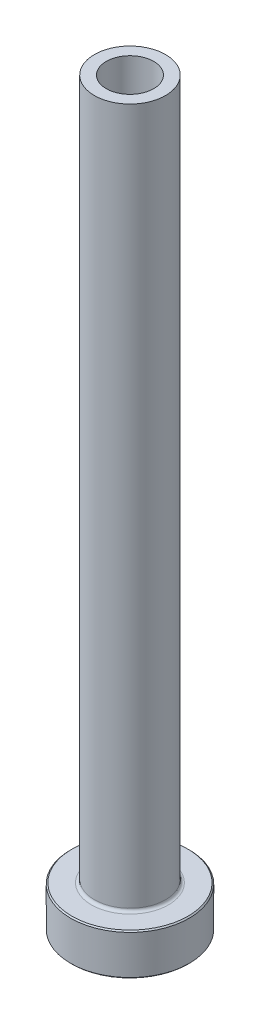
ISO-10303-21;
HEADER;
FILE_DESCRIPTION(('STEP AP214'),'2;1');
FILE_NAME('part.step','',(''),(''),'','','');
FILE_SCHEMA(('AUTOMOTIVE_DESIGN { 1 0 10303 214 1 1 1 1 }'));
ENDSEC;
DATA;
#1=APPLICATION_CONTEXT('core data for automotive mechanical design processes');
#2=APPLICATION_PROTOCOL_DEFINITION('international standard','automotive_design',2000,#1);
#3=PRODUCT_CONTEXT('',#1,'mechanical');
#4=PRODUCT('Part','Part','',(#3));
#5=PRODUCT_RELATED_PRODUCT_CATEGORY('part','',(#4));
#6=PRODUCT_DEFINITION_FORMATION('','',#4);
#7=PRODUCT_DEFINITION_CONTEXT('part definition',#1,'design');
#8=PRODUCT_DEFINITION('design','',#6,#7);
#9=PRODUCT_DEFINITION_SHAPE('','',#8);
#10=(LENGTH_UNIT() NAMED_UNIT(*) SI_UNIT(.MILLI.,.METRE.));
#11=(NAMED_UNIT(*) PLANE_ANGLE_UNIT() SI_UNIT($,.RADIAN.));
#12=(NAMED_UNIT(*) SI_UNIT($,.STERADIAN.) SOLID_ANGLE_UNIT());
#13=UNCERTAINTY_MEASURE_WITH_UNIT(LENGTH_MEASURE(1.E-05),#10,'distance_accuracy_value','');
#14=(GEOMETRIC_REPRESENTATION_CONTEXT(3) GLOBAL_UNCERTAINTY_ASSIGNED_CONTEXT((#13)) GLOBAL_UNIT_ASSIGNED_CONTEXT((#10,
#11,#12)) REPRESENTATION_CONTEXT('',''));
#15=CARTESIAN_POINT('',(0.,0.,0.));
#16=DIRECTION('',(0.,0.,1.));
#17=DIRECTION('',(1.,0.,0.));
#18=AXIS2_PLACEMENT_3D('',#15,#16,#17);
#19=CARTESIAN_POINT('',(0.,92.1876809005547,0.));
#20=DIRECTION('',(0.,1.,0.));
#21=DIRECTION('',(0.,0.,1.));
#22=AXIS2_PLACEMENT_3D('',#19,#20,#21);
#23=CYLINDRICAL_SURFACE('',#22,3.99999999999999);
#24=CARTESIAN_POINT('',(0.,125.,0.));
#25=DIRECTION('',(0.,1.,0.));
#26=DIRECTION('',(0.,0.,1.));
#27=AXIS2_PLACEMENT_3D('',#24,#25,#26);
#28=CIRCLE('',#27,4.);
#29=CARTESIAN_POINT('',(0.,125.,4.));
#30=VERTEX_POINT('',#29);
#31=EDGE_CURVE('E62',#30,#30,#28,.T.);
#32=ORIENTED_EDGE('',*,*,#31,.T.);
#33=EDGE_LOOP('',(#32));
#34=FACE_BOUND('',#33,.T.);
#35=CARTESIAN_POINT('',(0.,80.,0.));
#36=DIRECTION('',(0.,1.,0.));
#37=DIRECTION('',(0.,0.,1.));
#38=AXIS2_PLACEMENT_3D('',#35,#36,#37);
#39=CIRCLE('',#38,3.99999999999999);
#40=CARTESIAN_POINT('',(0.,80.,3.99999999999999));
#41=VERTEX_POINT('',#40);
#42=EDGE_CURVE('E71',#41,#41,#39,.T.);
#43=ORIENTED_EDGE('',*,*,#42,.F.);
#44=EDGE_LOOP('',(#43));
#45=FACE_BOUND('',#44,.T.);
#46=ADVANCED_FACE('F30',(#34,#45),#23,.F.);
#47=CARTESIAN_POINT('',(-4.,125.,0.));
#48=DIRECTION('',(0.,1.,0.));
#49=DIRECTION('',(0.,0.,1.));
#50=AXIS2_PLACEMENT_3D('',#47,#48,#49);
#51=PLANE('',#50);
#52=CARTESIAN_POINT('',(0.,125.,0.));
#53=DIRECTION('',(0.,1.,0.));
#54=DIRECTION('',(0.,0.,1.));
#55=AXIS2_PLACEMENT_3D('',#52,#53,#54);
#56=CIRCLE('',#55,6.);
#57=CARTESIAN_POINT('',(0.,125.,6.));
#58=VERTEX_POINT('',#57);
#59=EDGE_CURVE('E65',#58,#58,#56,.T.);
#60=ORIENTED_EDGE('',*,*,#59,.T.);
#61=EDGE_LOOP('',(#60));
#62=FACE_BOUND('',#61,.T.);
#63=ORIENTED_EDGE('',*,*,#31,.F.);
#64=EDGE_LOOP('',(#63));
#65=FACE_BOUND('',#64,.T.);
#66=ADVANCED_FACE('F79',(#62,#65),#51,.T.);
#67=CARTESIAN_POINT('',(0.,92.1876809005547,0.));
#68=DIRECTION('',(0.,1.,0.));
#69=DIRECTION('',(0.,0.,1.));
#70=AXIS2_PLACEMENT_3D('',#67,#68,#69);
#71=CYLINDRICAL_SURFACE('',#70,6.);
#72=CARTESIAN_POINT('',(0.,7.50000000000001,0.));
#73=DIRECTION('',(0.,1.,0.));
#74=DIRECTION('',(0.,0.,1.));
#75=AXIS2_PLACEMENT_3D('',#72,#73,#74);
#76=CIRCLE('',#75,6.);
#77=CARTESIAN_POINT('',(0.,7.50000000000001,6.));
#78=VERTEX_POINT('',#77);
#79=EDGE_CURVE('E59',#78,#78,#76,.T.);
#80=ORIENTED_EDGE('',*,*,#79,.T.);
#81=EDGE_LOOP('',(#80));
#82=FACE_BOUND('',#81,.T.);
#83=ORIENTED_EDGE('',*,*,#59,.F.);
#84=EDGE_LOOP('',(#83));
#85=FACE_BOUND('',#84,.T.);
#86=ADVANCED_FACE('F85',(#82,#85),#71,.T.);
#87=CARTESIAN_POINT('',(-5.99999999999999,7.,0.));
#88=DIRECTION('',(0.,1.,0.));
#89=DIRECTION('',(0.,0.,1.));
#90=AXIS2_PLACEMENT_3D('',#87,#88,#89);
#91=PLANE('',#90);
#92=CARTESIAN_POINT('',(0.,7.,0.));
#93=DIRECTION('',(0.,1.,0.));
#94=DIRECTION('',(0.,0.,1.));
#95=AXIS2_PLACEMENT_3D('',#92,#93,#94);
#96=CIRCLE('',#95,9.79999999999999);
#97=CARTESIAN_POINT('',(0.,7.,9.79999999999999));
#98=VERTEX_POINT('',#97);
#99=EDGE_CURVE('E53',#98,#98,#96,.T.);
#100=ORIENTED_EDGE('',*,*,#99,.T.);
#101=EDGE_LOOP('',(#100));
#102=FACE_BOUND('',#101,.T.);
#103=CARTESIAN_POINT('',(0.,7.,0.));
#104=DIRECTION('',(0.,1.,0.));
#105=DIRECTION('',(0.,0.,1.));
#106=AXIS2_PLACEMENT_3D('',#103,#104,#105);
#107=CIRCLE('',#106,6.5);
#108=CARTESIAN_POINT('',(0.,7.,6.5));
#109=VERTEX_POINT('',#108);
#110=EDGE_CURVE('E56',#109,#109,#107,.F.);
#111=ORIENTED_EDGE('',*,*,#110,.T.);
#112=EDGE_LOOP('',(#111));
#113=FACE_BOUND('',#112,.T.);
#114=ADVANCED_FACE('F111',(#102,#113),#91,.T.);
#115=CARTESIAN_POINT('',(0.,92.1876809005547,0.));
#116=DIRECTION('',(0.,1.,0.));
#117=DIRECTION('',(0.,0.,1.));
#118=AXIS2_PLACEMENT_3D('',#115,#116,#117);
#119=CYLINDRICAL_SURFACE('',#118,9.99999999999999);
#120=CARTESIAN_POINT('',(0.,6.8,0.));
#121=DIRECTION('',(0.,1.,0.));
#122=DIRECTION('',(0.,0.,1.));
#123=AXIS2_PLACEMENT_3D('',#120,#121,#122);
#124=CIRCLE('',#123,9.99999999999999);
#125=CARTESIAN_POINT('',(0.,6.8,9.99999999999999));
#126=VERTEX_POINT('',#125);
#127=EDGE_CURVE('E45',#126,#126,#124,.F.);
#128=ORIENTED_EDGE('',*,*,#127,.T.);
#129=EDGE_LOOP('',(#128));
#130=FACE_BOUND('',#129,.T.);
#131=CARTESIAN_POINT('',(0.,0.200000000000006,0.));
#132=DIRECTION('',(0.,-1.,0.));
#133=DIRECTION('',(0.,0.,-1.));
#134=AXIS2_PLACEMENT_3D('',#131,#132,#133);
#135=CIRCLE('',#134,9.99999999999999);
#136=CARTESIAN_POINT('',(0.,0.200000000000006,-9.99999999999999));
#137=VERTEX_POINT('',#136);
#138=EDGE_CURVE('E50',#137,#137,#135,.F.);
#139=ORIENTED_EDGE('',*,*,#138,.T.);
#140=EDGE_LOOP('',(#139));
#141=FACE_BOUND('',#140,.T.);
#142=ADVANCED_FACE('F108',(#130,#141),#119,.T.);
#143=CARTESIAN_POINT('',(-9.99999999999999,0.,0.));
#144=DIRECTION('',(0.,-1.,0.));
#145=DIRECTION('',(0.,0.,-1.));
#146=AXIS2_PLACEMENT_3D('',#143,#144,#145);
#147=PLANE('',#146);
#148=CARTESIAN_POINT('',(0.,0.,0.));
#149=DIRECTION('',(0.,-1.,0.));
#150=DIRECTION('',(0.,0.,-1.));
#151=AXIS2_PLACEMENT_3D('',#148,#149,#150);
#152=CIRCLE('',#151,4.74999999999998);
#153=CARTESIAN_POINT('',(0.,0.,-4.74999999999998));
#154=VERTEX_POINT('',#153);
#155=EDGE_CURVE('E37',#154,#154,#152,.F.);
#156=ORIENTED_EDGE('',*,*,#155,.T.);
#157=EDGE_LOOP('',(#156));
#158=FACE_BOUND('',#157,.T.);
#159=CARTESIAN_POINT('',(0.,0.,0.));
#160=DIRECTION('',(0.,-1.,0.));
#161=DIRECTION('',(0.,0.,-1.));
#162=AXIS2_PLACEMENT_3D('',#159,#160,#161);
#163=CIRCLE('',#162,9.79999999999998);
#164=CARTESIAN_POINT('',(0.,0.,-9.79999999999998));
#165=VERTEX_POINT('',#164);
#166=EDGE_CURVE('E41',#165,#165,#163,.T.);
#167=ORIENTED_EDGE('',*,*,#166,.T.);
#168=EDGE_LOOP('',(#167));
#169=FACE_BOUND('',#168,.T.);
#170=ADVANCED_FACE('F110',(#158,#169),#147,.T.);
#171=CARTESIAN_POINT('',(0.,92.1876809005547,0.));
#172=DIRECTION('',(0.,1.,0.));
#173=DIRECTION('',(0.,0.,1.));
#174=AXIS2_PLACEMENT_3D('',#171,#172,#173);
#175=CYLINDRICAL_SURFACE('',#174,4.24999999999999);
#176=CARTESIAN_POINT('',(0.,0.5,0.));
#177=DIRECTION('',(0.,-1.,0.));
#178=DIRECTION('',(0.,0.,-1.));
#179=AXIS2_PLACEMENT_3D('',#176,#177,#178);
#180=CIRCLE('',#179,4.24999999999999);
#181=CARTESIAN_POINT('',(0.,0.5,-4.24999999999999));
#182=VERTEX_POINT('',#181);
#183=EDGE_CURVE('E10',#182,#182,#180,.T.);
#184=ORIENTED_EDGE('',*,*,#183,.T.);
#185=EDGE_LOOP('',(#184));
#186=FACE_BOUND('',#185,.T.);
#187=CARTESIAN_POINT('',(0.,68.,0.));
#188=DIRECTION('',(0.,1.,0.));
#189=DIRECTION('',(0.,0.,1.));
#190=AXIS2_PLACEMENT_3D('',#187,#188,#189);
#191=CIRCLE('',#190,4.25);
#192=CARTESIAN_POINT('',(0.,68.,4.25));
#193=VERTEX_POINT('',#192);
#194=EDGE_CURVE('E68',#193,#193,#191,.T.);
#195=ORIENTED_EDGE('',*,*,#194,.T.);
#196=EDGE_LOOP('',(#195));
#197=FACE_BOUND('',#196,.T.);
#198=ADVANCED_FACE('F118',(#186,#197),#175,.F.);
#199=CARTESIAN_POINT('',(0.,68.,0.));
#200=DIRECTION('',(0.,-1.,0.));
#201=DIRECTION('',(0.,0.,-1.));
#202=AXIS2_PLACEMENT_3D('',#199,#200,#201);
#203=CONICAL_SURFACE('',#202,4.25,0.0208303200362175);
#204=ORIENTED_EDGE('',*,*,#42,.T.);
#205=EDGE_LOOP('',(#204));
#206=FACE_BOUND('',#205,.T.);
#207=ORIENTED_EDGE('',*,*,#194,.F.);
#208=EDGE_LOOP('',(#207));
#209=FACE_BOUND('',#208,.T.);
#210=ADVANCED_FACE('F75',(#206,#209),#203,.F.);
#211=CARTESIAN_POINT('',(0.,7.50000000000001,0.));
#212=DIRECTION('',(0.,1.,0.));
#213=DIRECTION('',(0.,0.,1.));
#214=AXIS2_PLACEMENT_3D('',#211,#212,#213);
#215=TOROIDAL_SURFACE('',#214,6.5,0.5);
#216=ORIENTED_EDGE('',*,*,#110,.F.);
#217=EDGE_LOOP('',(#216));
#218=FACE_BOUND('',#217,.T.);
#219=ORIENTED_EDGE('',*,*,#79,.F.);
#220=EDGE_LOOP('',(#219));
#221=FACE_BOUND('',#220,.T.);
#222=ADVANCED_FACE('F90',(#218,#221),#215,.F.);
#223=CARTESIAN_POINT('',(0.,7.00000000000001,0.));
#224=DIRECTION('',(0.,-1.,0.));
#225=DIRECTION('',(0.,0.,-1.));
#226=AXIS2_PLACEMENT_3D('',#223,#224,#225);
#227=CONICAL_SURFACE('',#226,9.79999999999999,0.785398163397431);
#228=ORIENTED_EDGE('',*,*,#127,.F.);
#229=EDGE_LOOP('',(#228));
#230=FACE_BOUND('',#229,.T.);
#231=ORIENTED_EDGE('',*,*,#99,.F.);
#232=EDGE_LOOP('',(#231));
#233=FACE_BOUND('',#232,.T.);
#234=ADVANCED_FACE('F93',(#230,#233),#227,.T.);
#235=CARTESIAN_POINT('',(0.,0.200000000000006,0.));
#236=DIRECTION('',(0.,1.,0.));
#237=DIRECTION('',(0.,0.,1.));
#238=AXIS2_PLACEMENT_3D('',#235,#236,#237);
#239=CONICAL_SURFACE('',#238,9.99999999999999,0.785398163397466);
#240=ORIENTED_EDGE('',*,*,#166,.F.);
#241=EDGE_LOOP('',(#240));
#242=FACE_BOUND('',#241,.T.);
#243=ORIENTED_EDGE('',*,*,#138,.F.);
#244=EDGE_LOOP('',(#243));
#245=FACE_BOUND('',#244,.T.);
#246=ADVANCED_FACE('F96',(#242,#245),#239,.T.);
#247=CARTESIAN_POINT('',(0.,0.,0.));
#248=DIRECTION('',(0.,-1.,0.));
#249=DIRECTION('',(0.,0.,-1.));
#250=AXIS2_PLACEMENT_3D('',#247,#248,#249);
#251=CONICAL_SURFACE('',#250,4.74999999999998,0.785398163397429);
#252=ORIENTED_EDGE('',*,*,#183,.F.);
#253=EDGE_LOOP('',(#252));
#254=FACE_BOUND('',#253,.T.);
#255=ORIENTED_EDGE('',*,*,#155,.F.);
#256=EDGE_LOOP('',(#255));
#257=FACE_BOUND('',#256,.T.);
#258=ADVANCED_FACE('F32',(#254,#257),#251,.F.);
#259=CLOSED_SHELL('',(#46,#66,#86,#114,#142,#170,#198,#210,#222,#234,#246,#258));
#260=MANIFOLD_SOLID_BREP('B2',#259);
#261=ADVANCED_BREP_SHAPE_REPRESENTATION('',(#18,#260),#14);
#262=SHAPE_DEFINITION_REPRESENTATION(#9,#261);
ENDSEC;
END-ISO-10303-21;
